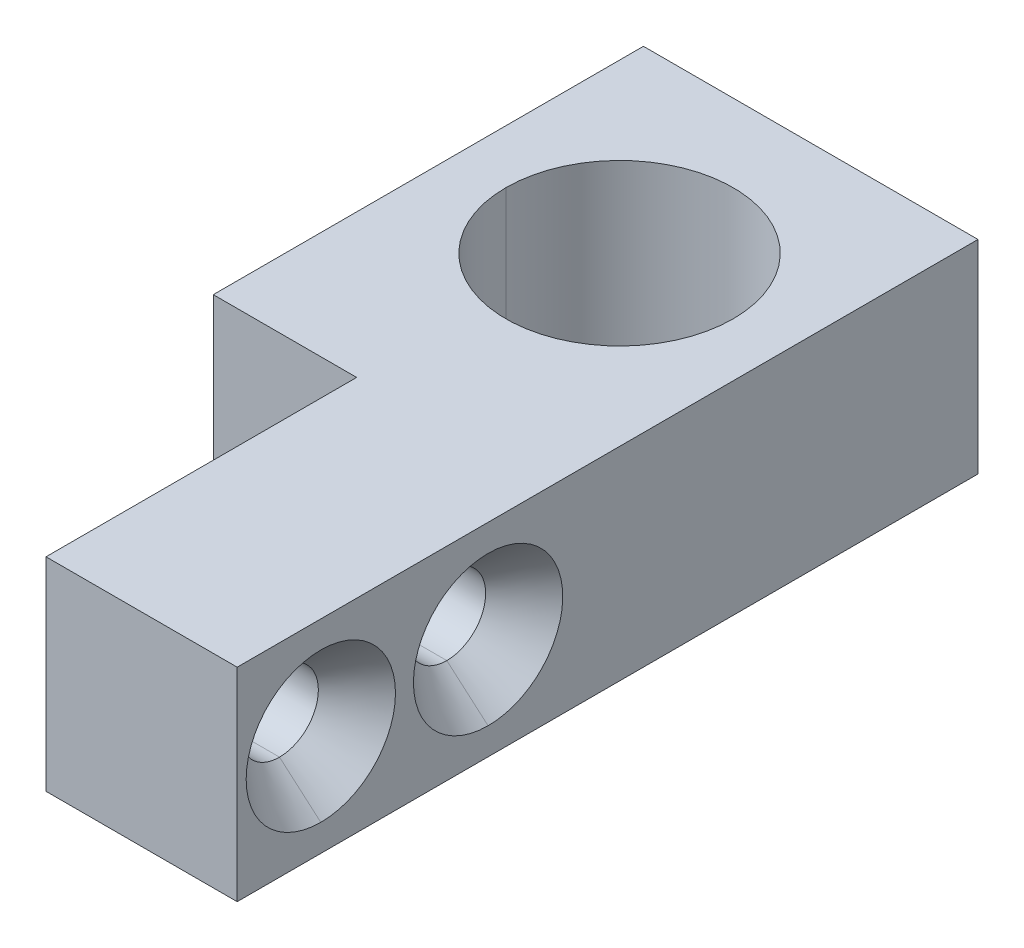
ISO-10303-21;
HEADER;
FILE_DESCRIPTION(('STEP AP214'),'2;1');
FILE_NAME('part.step','',(''),(''),'','','');
FILE_SCHEMA(('AUTOMOTIVE_DESIGN { 1 0 10303 214 1 1 1 1 }'));
ENDSEC;
DATA;
#1=APPLICATION_CONTEXT('core data for automotive mechanical design processes');
#2=APPLICATION_PROTOCOL_DEFINITION('international standard','automotive_design',2000,#1);
#3=PRODUCT_CONTEXT('',#1,'mechanical');
#4=PRODUCT('Part','Part','',(#3));
#5=PRODUCT_RELATED_PRODUCT_CATEGORY('part','',(#4));
#6=PRODUCT_DEFINITION_FORMATION('','',#4);
#7=PRODUCT_DEFINITION_CONTEXT('part definition',#1,'design');
#8=PRODUCT_DEFINITION('design','',#6,#7);
#9=PRODUCT_DEFINITION_SHAPE('','',#8);
#10=(LENGTH_UNIT() NAMED_UNIT(*) SI_UNIT(.MILLI.,.METRE.));
#11=(NAMED_UNIT(*) PLANE_ANGLE_UNIT() SI_UNIT($,.RADIAN.));
#12=(NAMED_UNIT(*) SI_UNIT($,.STERADIAN.) SOLID_ANGLE_UNIT());
#13=UNCERTAINTY_MEASURE_WITH_UNIT(LENGTH_MEASURE(1.E-05),#10,'distance_accuracy_value','');
#14=(GEOMETRIC_REPRESENTATION_CONTEXT(3) GLOBAL_UNCERTAINTY_ASSIGNED_CONTEXT((#13)) GLOBAL_UNIT_ASSIGNED_CONTEXT((#10,
#11,#12)) REPRESENTATION_CONTEXT('',''));
#15=CARTESIAN_POINT('',(0.,0.,0.));
#16=DIRECTION('',(0.,0.,1.));
#17=DIRECTION('',(1.,0.,0.));
#18=AXIS2_PLACEMENT_3D('',#15,#16,#17);
#19=CARTESIAN_POINT('',(16.2814000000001,0.,38.1));
#20=DIRECTION('',(-1.,0.,0.));
#21=DIRECTION('',(0.,0.,1.));
#22=AXIS2_PLACEMENT_3D('',#19,#20,#21);
#23=CYLINDRICAL_SURFACE('',#22,5.159375);
#24=CARTESIAN_POINT('',(-3.175,0.,38.1));
#25=DIRECTION('',(-1.,0.,0.));
#26=DIRECTION('',(0.,0.,1.));
#27=AXIS2_PLACEMENT_3D('',#24,#25,#26);
#28=CIRCLE('',#27,5.159375);
#29=CARTESIAN_POINT('',(-3.175,-5.159375,38.1));
#30=VERTEX_POINT('',#29);
#31=CARTESIAN_POINT('',(-3.175,5.159375,38.1));
#32=VERTEX_POINT('',#31);
#33=EDGE_CURVE('E228',#30,#32,#28,.T.);
#34=ORIENTED_EDGE('',*,*,#33,.T.);
#35=DIRECTION('',(-1.,0.,0.));
#36=VECTOR('',#35,1.);
#37=CARTESIAN_POINT('',(16.2814000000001,5.159375,38.1));
#38=LINE('',#37,#36);
#39=CARTESIAN_POINT('',(16.7388815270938,5.15937499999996,38.1));
#40=VERTEX_POINT('',#39);
#41=EDGE_CURVE('E175',#32,#40,#38,.F.);
#42=ORIENTED_EDGE('',*,*,#41,.T.);
#43=CARTESIAN_POINT('',(16.7388815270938,0.,38.1));
#44=DIRECTION('',(1.,0.,0.));
#45=DIRECTION('',(0.,1.,0.));
#46=AXIS2_PLACEMENT_3D('',#43,#44,#45);
#47=CIRCLE('',#46,5.15937499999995);
#48=CARTESIAN_POINT('',(16.7388815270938,-5.15937499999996,38.1));
#49=VERTEX_POINT('',#48);
#50=EDGE_CURVE('E147',#40,#49,#47,.T.);
#51=ORIENTED_EDGE('',*,*,#50,.T.);
#52=DIRECTION('',(-1.,0.,0.));
#53=VECTOR('',#52,1.);
#54=CARTESIAN_POINT('',(16.2814000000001,-5.159375,38.1));
#55=LINE('',#54,#53);
#56=EDGE_CURVE('E170',#49,#30,#55,.T.);
#57=ORIENTED_EDGE('',*,*,#56,.T.);
#58=EDGE_LOOP('',(#34,#42,#51,#57));
#59=FACE_BOUND('',#58,.T.);
#60=ADVANCED_FACE('F16',(#59),#23,.F.);
#61=CARTESIAN_POINT('',(16.2814000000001,0.,38.1));
#62=DIRECTION('',(-1.,0.,0.));
#63=DIRECTION('',(0.,0.,1.));
#64=AXIS2_PLACEMENT_3D('',#61,#62,#63);
#65=CYLINDRICAL_SURFACE('',#64,5.159375);
#66=CARTESIAN_POINT('',(16.7388815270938,0.,38.1));
#67=DIRECTION('',(1.,0.,0.));
#68=DIRECTION('',(0.,1.,0.));
#69=AXIS2_PLACEMENT_3D('',#66,#67,#68);
#70=CIRCLE('',#69,5.15937499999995);
#71=EDGE_CURVE('E141',#49,#40,#70,.T.);
#72=ORIENTED_EDGE('',*,*,#71,.T.);
#73=ORIENTED_EDGE('',*,*,#41,.F.);
#74=CARTESIAN_POINT('',(-3.175,0.,38.1));
#75=DIRECTION('',(-1.,0.,0.));
#76=DIRECTION('',(0.,0.,1.));
#77=AXIS2_PLACEMENT_3D('',#74,#75,#76);
#78=CIRCLE('',#77,5.159375);
#79=EDGE_CURVE('E225',#32,#30,#78,.T.);
#80=ORIENTED_EDGE('',*,*,#79,.T.);
#81=ORIENTED_EDGE('',*,*,#56,.F.);
#82=EDGE_LOOP('',(#72,#73,#80,#81));
#83=FACE_BOUND('',#82,.T.);
#84=ADVANCED_FACE('F310',(#83),#65,.F.);
#85=CARTESIAN_POINT('',(16.2814000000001,0.,15.875));
#86=DIRECTION('',(-1.,0.,0.));
#87=DIRECTION('',(0.,0.,1.));
#88=AXIS2_PLACEMENT_3D('',#85,#86,#87);
#89=CYLINDRICAL_SURFACE('',#88,5.159375);
#90=CARTESIAN_POINT('',(-3.175,0.,15.875));
#91=DIRECTION('',(-1.,0.,0.));
#92=DIRECTION('',(0.,0.,1.));
#93=AXIS2_PLACEMENT_3D('',#90,#91,#92);
#94=CIRCLE('',#93,5.159375);
#95=CARTESIAN_POINT('',(-3.175,-5.159375,15.875));
#96=VERTEX_POINT('',#95);
#97=CARTESIAN_POINT('',(-3.175,5.159375,15.875));
#98=VERTEX_POINT('',#97);
#99=EDGE_CURVE('E222',#96,#98,#94,.T.);
#100=ORIENTED_EDGE('',*,*,#99,.T.);
#101=DIRECTION('',(-1.,0.,0.));
#102=VECTOR('',#101,1.);
#103=CARTESIAN_POINT('',(16.2814000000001,5.159375,15.875));
#104=LINE('',#103,#102);
#105=CARTESIAN_POINT('',(16.7388815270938,5.15937499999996,15.875));
#106=VERTEX_POINT('',#105);
#107=EDGE_CURVE('E165',#98,#106,#104,.F.);
#108=ORIENTED_EDGE('',*,*,#107,.T.);
#109=CARTESIAN_POINT('',(16.7388815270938,0.,15.875));
#110=DIRECTION('',(1.,0.,0.));
#111=DIRECTION('',(0.,1.,0.));
#112=AXIS2_PLACEMENT_3D('',#109,#110,#111);
#113=CIRCLE('',#112,5.15937499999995);
#114=CARTESIAN_POINT('',(16.7388815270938,-5.15937499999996,15.875));
#115=VERTEX_POINT('',#114);
#116=EDGE_CURVE('E159',#106,#115,#113,.T.);
#117=ORIENTED_EDGE('',*,*,#116,.T.);
#118=DIRECTION('',(-1.,0.,0.));
#119=VECTOR('',#118,1.);
#120=CARTESIAN_POINT('',(16.2814000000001,-5.159375,15.875));
#121=LINE('',#120,#119);
#122=EDGE_CURVE('E162',#115,#96,#121,.T.);
#123=ORIENTED_EDGE('',*,*,#122,.T.);
#124=EDGE_LOOP('',(#100,#108,#117,#123));
#125=FACE_BOUND('',#124,.T.);
#126=ADVANCED_FACE('F307',(#125),#89,.F.);
#127=CARTESIAN_POINT('',(16.2814000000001,0.,15.875));
#128=DIRECTION('',(-1.,0.,0.));
#129=DIRECTION('',(0.,0.,1.));
#130=AXIS2_PLACEMENT_3D('',#127,#128,#129);
#131=CYLINDRICAL_SURFACE('',#130,5.159375);
#132=CARTESIAN_POINT('',(16.7388815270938,0.,15.875));
#133=DIRECTION('',(1.,0.,0.));
#134=DIRECTION('',(0.,1.,0.));
#135=AXIS2_PLACEMENT_3D('',#132,#133,#134);
#136=CIRCLE('',#135,5.15937499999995);
#137=EDGE_CURVE('E153',#115,#106,#136,.T.);
#138=ORIENTED_EDGE('',*,*,#137,.T.);
#139=ORIENTED_EDGE('',*,*,#107,.F.);
#140=CARTESIAN_POINT('',(-3.175,0.,15.875));
#141=DIRECTION('',(-1.,0.,0.));
#142=DIRECTION('',(0.,0.,1.));
#143=AXIS2_PLACEMENT_3D('',#140,#141,#142);
#144=CIRCLE('',#143,5.159375);
#145=EDGE_CURVE('E218',#98,#96,#144,.T.);
#146=ORIENTED_EDGE('',*,*,#145,.T.);
#147=ORIENTED_EDGE('',*,*,#122,.F.);
#148=EDGE_LOOP('',(#138,#139,#146,#147));
#149=FACE_BOUND('',#148,.T.);
#150=ADVANCED_FACE('F304',(#149),#131,.F.);
#151=CARTESIAN_POINT('',(9.525,13.49375,-20.6375));
#152=DIRECTION('',(0.,1.,0.));
#153=DIRECTION('',(0.,0.,1.));
#154=AXIS2_PLACEMENT_3D('',#151,#152,#153);
#155=PLANE('',#154);
#156=CARTESIAN_POINT('',(0.,13.49375,-23.8125));
#157=DIRECTION('',(0.,-1.,0.));
#158=DIRECTION('',(0.,0.,-1.));
#159=AXIS2_PLACEMENT_3D('',#156,#157,#158);
#160=CIRCLE('',#159,15.1003);
#161=CARTESIAN_POINT('',(15.1003,13.49375,-23.8125));
#162=VERTEX_POINT('',#161);
#163=CARTESIAN_POINT('',(-15.1003,13.49375,-23.8125000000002));
#164=VERTEX_POINT('',#163);
#165=EDGE_CURVE('E19',#162,#164,#160,.T.);
#166=ORIENTED_EDGE('',*,*,#165,.T.);
#167=CARTESIAN_POINT('',(0.,13.49375,-23.8125));
#168=DIRECTION('',(0.,-1.,0.));
#169=DIRECTION('',(0.,0.,-1.));
#170=AXIS2_PLACEMENT_3D('',#167,#168,#169);
#171=CIRCLE('',#170,15.1003);
#172=EDGE_CURVE('E124',#164,#162,#171,.T.);
#173=ORIENTED_EDGE('',*,*,#172,.T.);
#174=EDGE_LOOP('',(#166,#173));
#175=FACE_BOUND('',#174,.T.);
#176=DIRECTION('',(1.,0.,0.));
#177=VECTOR('',#176,1.);
#178=CARTESIAN_POINT('',(9.525,13.49375,-49.2125));
#179=LINE('',#178,#177);
#180=CARTESIAN_POINT('',(22.225,13.49375,-49.2125));
#181=VERTEX_POINT('',#180);
#182=CARTESIAN_POINT('',(-22.225,13.49375,-49.2125));
#183=VERTEX_POINT('',#182);
#184=EDGE_CURVE('E245',#181,#183,#179,.F.);
#185=ORIENTED_EDGE('',*,*,#184,.T.);
#186=DIRECTION('',(0.,0.,-1.));
#187=VECTOR('',#186,1.);
#188=CARTESIAN_POINT('',(-22.225,13.49375,-20.6375));
#189=LINE('',#188,#187);
#190=CARTESIAN_POINT('',(-22.225,13.49375,7.9375));
#191=VERTEX_POINT('',#190);
#192=EDGE_CURVE('E237',#183,#191,#189,.F.);
#193=ORIENTED_EDGE('',*,*,#192,.T.);
#194=DIRECTION('',(-1.,0.,0.));
#195=VECTOR('',#194,1.);
#196=CARTESIAN_POINT('',(9.525,13.49375,7.9375));
#197=LINE('',#196,#195);
#198=CARTESIAN_POINT('',(-3.175,13.49375,7.9375));
#199=VERTEX_POINT('',#198);
#200=EDGE_CURVE('E230',#191,#199,#197,.F.);
#201=ORIENTED_EDGE('',*,*,#200,.T.);
#202=DIRECTION('',(0.,0.,-1.));
#203=VECTOR('',#202,1.);
#204=CARTESIAN_POINT('',(-3.175,13.49375,17.4625));
#205=LINE('',#204,#203);
#206=CARTESIAN_POINT('',(-3.175,13.49375,49.2125));
#207=VERTEX_POINT('',#206);
#208=EDGE_CURVE('E337',#199,#207,#205,.F.);
#209=ORIENTED_EDGE('',*,*,#208,.T.);
#210=DIRECTION('',(-1.,0.,0.));
#211=VECTOR('',#210,1.);
#212=CARTESIAN_POINT('',(17.4625,13.49375,49.2125));
#213=LINE('',#212,#211);
#214=CARTESIAN_POINT('',(22.225,13.49375,49.2125));
#215=VERTEX_POINT('',#214);
#216=EDGE_CURVE('E329',#207,#215,#213,.F.);
#217=ORIENTED_EDGE('',*,*,#216,.T.);
#218=DIRECTION('',(0.,0.,1.));
#219=VECTOR('',#218,1.);
#220=CARTESIAN_POINT('',(22.225,13.49375,-20.6375));
#221=LINE('',#220,#219);
#222=EDGE_CURVE('E325',#215,#181,#221,.F.);
#223=ORIENTED_EDGE('',*,*,#222,.T.);
#224=EDGE_LOOP('',(#185,#193,#201,#209,#217,#223));
#225=FACE_BOUND('',#224,.T.);
#226=ADVANCED_FACE('F122',(#175,#225),#155,.T.);
#227=CARTESIAN_POINT('',(22.225,0.,15.875));
#228=DIRECTION('',(1.,0.,0.));
#229=DIRECTION('',(0.,0.,-1.));
#230=AXIS2_PLACEMENT_3D('',#227,#228,#229);
#231=CONICAL_SURFACE('',#230,9.91869999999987,0.714578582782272);
#232=CARTESIAN_POINT('',(22.225,0.,15.875));
#233=DIRECTION('',(1.,0.,0.));
#234=DIRECTION('',(0.,0.,-1.));
#235=AXIS2_PLACEMENT_3D('',#232,#233,#234);
#236=CIRCLE('',#235,9.91869999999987);
#237=CARTESIAN_POINT('',(22.225,9.91869999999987,15.875));
#238=VERTEX_POINT('',#237);
#239=CARTESIAN_POINT('',(22.225,-9.91869999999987,15.875));
#240=VERTEX_POINT('',#239);
#241=EDGE_CURVE('E214',#238,#240,#236,.T.);
#242=ORIENTED_EDGE('',*,*,#241,.T.);
#243=DIRECTION('',(-0.755369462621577,0.655299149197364,0.));
#244=VECTOR('',#243,1.);
#245=CARTESIAN_POINT('',(19.2532000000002,-7.34060000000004,15.875));
#246=LINE('',#245,#244);
#247=EDGE_CURVE('E156',#240,#115,#246,.T.);
#248=ORIENTED_EDGE('',*,*,#247,.T.);
#249=ORIENTED_EDGE('',*,*,#116,.F.);
#250=DIRECTION('',(-0.755369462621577,-0.655299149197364,0.));
#251=VECTOR('',#250,1.);
#252=CARTESIAN_POINT('',(19.2532000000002,7.34060000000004,15.875));
#253=LINE('',#252,#251);
#254=EDGE_CURVE('E150',#106,#238,#253,.F.);
#255=ORIENTED_EDGE('',*,*,#254,.T.);
#256=EDGE_LOOP('',(#242,#248,#249,#255));
#257=FACE_BOUND('',#256,.T.);
#258=ADVANCED_FACE('F297',(#257),#231,.F.);
#259=CARTESIAN_POINT('',(22.225,0.,15.875));
#260=DIRECTION('',(1.,0.,0.));
#261=DIRECTION('',(0.,0.,-1.));
#262=AXIS2_PLACEMENT_3D('',#259,#260,#261);
#263=CONICAL_SURFACE('',#262,9.91869999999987,0.714578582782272);
#264=ORIENTED_EDGE('',*,*,#137,.F.);
#265=ORIENTED_EDGE('',*,*,#247,.F.);
#266=CARTESIAN_POINT('',(22.225,0.,15.875));
#267=DIRECTION('',(1.,0.,0.));
#268=DIRECTION('',(0.,0.,-1.));
#269=AXIS2_PLACEMENT_3D('',#266,#267,#268);
#270=CIRCLE('',#269,9.91869999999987);
#271=CARTESIAN_POINT('',(22.225,-5.94783182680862,7.9375));
#272=VERTEX_POINT('',#271);
#273=EDGE_CURVE('E211',#240,#272,#270,.T.);
#274=ORIENTED_EDGE('',*,*,#273,.T.);
#275=CARTESIAN_POINT('',(22.225,0.,15.875));
#276=DIRECTION('',(1.,0.,0.));
#277=DIRECTION('',(0.,0.,-1.));
#278=AXIS2_PLACEMENT_3D('',#275,#276,#277);
#279=CIRCLE('',#278,9.91869999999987);
#280=EDGE_CURVE('E208',#272,#238,#279,.T.);
#281=ORIENTED_EDGE('',*,*,#280,.T.);
#282=ORIENTED_EDGE('',*,*,#254,.F.);
#283=EDGE_LOOP('',(#264,#265,#274,#281,#282));
#284=FACE_BOUND('',#283,.T.);
#285=ADVANCED_FACE('F293',(#284),#263,.F.);
#286=CARTESIAN_POINT('',(22.225,0.,38.1));
#287=DIRECTION('',(1.,0.,0.));
#288=DIRECTION('',(0.,0.,-1.));
#289=AXIS2_PLACEMENT_3D('',#286,#287,#288);
#290=CONICAL_SURFACE('',#289,9.91869999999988,0.714578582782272);
#291=CARTESIAN_POINT('',(22.225,0.,38.1));
#292=DIRECTION('',(1.,0.,0.));
#293=DIRECTION('',(0.,0.,-1.));
#294=AXIS2_PLACEMENT_3D('',#291,#292,#293);
#295=CIRCLE('',#294,9.91869999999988);
#296=CARTESIAN_POINT('',(22.225,9.91869999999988,38.1));
#297=VERTEX_POINT('',#296);
#298=CARTESIAN_POINT('',(22.225,-9.91869999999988,38.1));
#299=VERTEX_POINT('',#298);
#300=EDGE_CURVE('E205',#297,#299,#295,.T.);
#301=ORIENTED_EDGE('',*,*,#300,.T.);
#302=DIRECTION('',(-0.755369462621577,0.655299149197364,0.));
#303=VECTOR('',#302,1.);
#304=CARTESIAN_POINT('',(19.2532000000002,-7.34060000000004,38.1));
#305=LINE('',#304,#303);
#306=EDGE_CURVE('E144',#299,#49,#305,.T.);
#307=ORIENTED_EDGE('',*,*,#306,.T.);
#308=ORIENTED_EDGE('',*,*,#50,.F.);
#309=DIRECTION('',(-0.755369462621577,-0.655299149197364,0.));
#310=VECTOR('',#309,1.);
#311=CARTESIAN_POINT('',(19.2532000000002,7.34060000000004,38.1));
#312=LINE('',#311,#310);
#313=EDGE_CURVE('E126',#40,#297,#312,.F.);
#314=ORIENTED_EDGE('',*,*,#313,.T.);
#315=EDGE_LOOP('',(#301,#307,#308,#314));
#316=FACE_BOUND('',#315,.T.);
#317=ADVANCED_FACE('F289',(#316),#290,.F.);
#318=CARTESIAN_POINT('',(22.225,0.,38.1));
#319=DIRECTION('',(1.,0.,0.));
#320=DIRECTION('',(0.,0.,-1.));
#321=AXIS2_PLACEMENT_3D('',#318,#319,#320);
#322=CONICAL_SURFACE('',#321,9.91869999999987,0.714578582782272);
#323=ORIENTED_EDGE('',*,*,#71,.F.);
#324=ORIENTED_EDGE('',*,*,#306,.F.);
#325=CARTESIAN_POINT('',(22.225,0.,38.1));
#326=DIRECTION('',(1.,0.,0.));
#327=DIRECTION('',(0.,0.,-1.));
#328=AXIS2_PLACEMENT_3D('',#325,#326,#327);
#329=CIRCLE('',#328,9.91869999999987);
#330=EDGE_CURVE('E202',#299,#297,#329,.T.);
#331=ORIENTED_EDGE('',*,*,#330,.T.);
#332=ORIENTED_EDGE('',*,*,#313,.F.);
#333=EDGE_LOOP('',(#323,#324,#331,#332));
#334=FACE_BOUND('',#333,.T.);
#335=ADVANCED_FACE('F286',(#334),#322,.F.);
#336=CARTESIAN_POINT('',(0.,0.79375,-23.8125));
#337=DIRECTION('',(0.,-1.,0.));
#338=DIRECTION('',(0.,0.,-1.));
#339=AXIS2_PLACEMENT_3D('',#336,#337,#338);
#340=CYLINDRICAL_SURFACE('',#339,15.1003);
#341=CARTESIAN_POINT('',(0.,-13.49375,-23.8125));
#342=DIRECTION('',(0.,-1.,0.));
#343=DIRECTION('',(0.,0.,-1.));
#344=AXIS2_PLACEMENT_3D('',#341,#342,#343);
#345=CIRCLE('',#344,15.1003);
#346=CARTESIAN_POINT('',(15.1003,-13.49375,-23.8125));
#347=VERTEX_POINT('',#346);
#348=CARTESIAN_POINT('',(-15.1003,-13.49375,-23.8125));
#349=VERTEX_POINT('',#348);
#350=EDGE_CURVE('E134',#347,#349,#345,.T.);
#351=ORIENTED_EDGE('',*,*,#350,.T.);
#352=DIRECTION('',(0.,-1.,0.));
#353=VECTOR('',#352,1.);
#354=CARTESIAN_POINT('',(-15.1003,0.79375,-23.8125));
#355=LINE('',#354,#353);
#356=EDGE_CURVE('E125',#349,#164,#355,.F.);
#357=ORIENTED_EDGE('',*,*,#356,.T.);
#358=ORIENTED_EDGE('',*,*,#165,.F.);
#359=DIRECTION('',(0.,-1.,0.));
#360=VECTOR('',#359,1.);
#361=CARTESIAN_POINT('',(15.1003,0.79375,-23.8125));
#362=LINE('',#361,#360);
#363=EDGE_CURVE('E131',#162,#347,#362,.T.);
#364=ORIENTED_EDGE('',*,*,#363,.T.);
#365=EDGE_LOOP('',(#351,#357,#358,#364));
#366=FACE_BOUND('',#365,.T.);
#367=ADVANCED_FACE('F133',(#366),#340,.F.);
#368=CARTESIAN_POINT('',(0.,0.79375,-23.8125));
#369=DIRECTION('',(0.,-1.,0.));
#370=DIRECTION('',(0.,0.,-1.));
#371=AXIS2_PLACEMENT_3D('',#368,#369,#370);
#372=CYLINDRICAL_SURFACE('',#371,15.1003);
#373=ORIENTED_EDGE('',*,*,#172,.F.);
#374=ORIENTED_EDGE('',*,*,#356,.F.);
#375=CARTESIAN_POINT('',(0.,-13.49375,-23.8125));
#376=DIRECTION('',(0.,-1.,0.));
#377=DIRECTION('',(0.,0.,-1.));
#378=AXIS2_PLACEMENT_3D('',#375,#376,#377);
#379=CIRCLE('',#378,15.1003);
#380=EDGE_CURVE('E198',#349,#347,#379,.T.);
#381=ORIENTED_EDGE('',*,*,#380,.T.);
#382=ORIENTED_EDGE('',*,*,#363,.F.);
#383=EDGE_LOOP('',(#373,#374,#381,#382));
#384=FACE_BOUND('',#383,.T.);
#385=ADVANCED_FACE('F128',(#384),#372,.F.);
#386=CARTESIAN_POINT('',(9.525,0.,-49.2125));
#387=DIRECTION('',(0.,0.,1.));
#388=DIRECTION('',(1.,0.,0.));
#389=AXIS2_PLACEMENT_3D('',#386,#387,#388);
#390=PLANE('',#389);
#391=DIRECTION('',(0.,1.,0.));
#392=VECTOR('',#391,1.);
#393=CARTESIAN_POINT('',(-22.225,0.,-49.2125));
#394=LINE('',#393,#392);
#395=CARTESIAN_POINT('',(-22.225,-13.49375,-49.2125));
#396=VERTEX_POINT('',#395);
#397=EDGE_CURVE('E243',#396,#183,#394,.T.);
#398=ORIENTED_EDGE('',*,*,#397,.T.);
#399=ORIENTED_EDGE('',*,*,#184,.F.);
#400=DIRECTION('',(0.,1.,0.));
#401=VECTOR('',#400,1.);
#402=CARTESIAN_POINT('',(22.225,0.,-49.2125));
#403=LINE('',#402,#401);
#404=CARTESIAN_POINT('',(22.225,-13.49375,-49.2125));
#405=VERTEX_POINT('',#404);
#406=EDGE_CURVE('E217',#181,#405,#403,.F.);
#407=ORIENTED_EDGE('',*,*,#406,.T.);
#408=DIRECTION('',(1.,0.,0.));
#409=VECTOR('',#408,1.);
#410=CARTESIAN_POINT('',(9.525,-13.49375,-49.2125));
#411=LINE('',#410,#409);
#412=EDGE_CURVE('E200',#405,#396,#411,.F.);
#413=ORIENTED_EDGE('',*,*,#412,.T.);
#414=EDGE_LOOP('',(#398,#399,#407,#413));
#415=FACE_BOUND('',#414,.T.);
#416=ADVANCED_FACE('F277',(#415),#390,.F.);
#417=CARTESIAN_POINT('',(-22.225,0.,-20.6375));
#418=DIRECTION('',(1.,0.,0.));
#419=DIRECTION('',(0.,0.,-1.));
#420=AXIS2_PLACEMENT_3D('',#417,#418,#419);
#421=PLANE('',#420);
#422=ORIENTED_EDGE('',*,*,#192,.F.);
#423=ORIENTED_EDGE('',*,*,#397,.F.);
#424=DIRECTION('',(0.,0.,1.));
#425=VECTOR('',#424,1.);
#426=CARTESIAN_POINT('',(-22.225,-13.49375,-20.6375));
#427=LINE('',#426,#425);
#428=CARTESIAN_POINT('',(-22.225,-13.49375,7.9375));
#429=VERTEX_POINT('',#428);
#430=EDGE_CURVE('E351',#396,#429,#427,.T.);
#431=ORIENTED_EDGE('',*,*,#430,.T.);
#432=DIRECTION('',(0.,1.,0.));
#433=VECTOR('',#432,1.);
#434=CARTESIAN_POINT('',(-22.225,0.,7.9375));
#435=LINE('',#434,#433);
#436=EDGE_CURVE('E232',#429,#191,#435,.T.);
#437=ORIENTED_EDGE('',*,*,#436,.T.);
#438=EDGE_LOOP('',(#422,#423,#431,#437));
#439=FACE_BOUND('',#438,.T.);
#440=ADVANCED_FACE('F273',(#439),#421,.F.);
#441=CARTESIAN_POINT('',(9.525,0.,7.9375));
#442=DIRECTION('',(0.,0.,-1.));
#443=DIRECTION('',(-1.,0.,0.));
#444=AXIS2_PLACEMENT_3D('',#441,#442,#443);
#445=PLANE('',#444);
#446=ORIENTED_EDGE('',*,*,#200,.F.);
#447=ORIENTED_EDGE('',*,*,#436,.F.);
#448=DIRECTION('',(1.,0.,0.));
#449=VECTOR('',#448,1.);
#450=CARTESIAN_POINT('',(9.525,-13.49375,7.9375));
#451=LINE('',#450,#449);
#452=CARTESIAN_POINT('',(-3.175,-13.49375,7.9375));
#453=VERTEX_POINT('',#452);
#454=EDGE_CURVE('E341',#429,#453,#451,.T.);
#455=ORIENTED_EDGE('',*,*,#454,.T.);
#456=DIRECTION('',(0.,1.,0.));
#457=VECTOR('',#456,1.);
#458=CARTESIAN_POINT('',(-3.175,0.,7.9375));
#459=LINE('',#458,#457);
#460=EDGE_CURVE('E221',#453,#199,#459,.T.);
#461=ORIENTED_EDGE('',*,*,#460,.T.);
#462=EDGE_LOOP('',(#446,#447,#455,#461));
#463=FACE_BOUND('',#462,.T.);
#464=ADVANCED_FACE('F269',(#463),#445,.F.);
#465=CARTESIAN_POINT('',(-3.175,0.,17.4625));
#466=DIRECTION('',(1.,0.,0.));
#467=DIRECTION('',(0.,0.,-1.));
#468=AXIS2_PLACEMENT_3D('',#465,#466,#467);
#469=PLANE('',#468);
#470=DIRECTION('',(0.,1.,0.));
#471=VECTOR('',#470,1.);
#472=CARTESIAN_POINT('',(-3.175,0.,49.2125));
#473=LINE('',#472,#471);
#474=CARTESIAN_POINT('',(-3.175,-13.49375,49.2125));
#475=VERTEX_POINT('',#474);
#476=EDGE_CURVE('E335',#475,#207,#473,.T.);
#477=ORIENTED_EDGE('',*,*,#476,.T.);
#478=ORIENTED_EDGE('',*,*,#208,.F.);
#479=ORIENTED_EDGE('',*,*,#460,.F.);
#480=DIRECTION('',(0.,0.,1.));
#481=VECTOR('',#480,1.);
#482=CARTESIAN_POINT('',(-3.175,-13.49375,-20.6375));
#483=LINE('',#482,#481);
#484=EDGE_CURVE('E345',#453,#475,#483,.T.);
#485=ORIENTED_EDGE('',*,*,#484,.T.);
#486=EDGE_LOOP('',(#477,#478,#479,#485));
#487=FACE_BOUND('',#486,.T.);
#488=ORIENTED_EDGE('',*,*,#99,.F.);
#489=ORIENTED_EDGE('',*,*,#145,.F.);
#490=EDGE_LOOP('',(#488,#489));
#491=FACE_BOUND('',#490,.T.);
#492=ORIENTED_EDGE('',*,*,#33,.F.);
#493=ORIENTED_EDGE('',*,*,#79,.F.);
#494=EDGE_LOOP('',(#492,#493));
#495=FACE_BOUND('',#494,.T.);
#496=ADVANCED_FACE('F265',(#487,#491,#495),#469,.F.);
#497=CARTESIAN_POINT('',(17.4625,0.,49.2125));
#498=DIRECTION('',(0.,0.,-1.));
#499=DIRECTION('',(-1.,0.,0.));
#500=AXIS2_PLACEMENT_3D('',#497,#498,#499);
#501=PLANE('',#500);
#502=ORIENTED_EDGE('',*,*,#216,.F.);
#503=ORIENTED_EDGE('',*,*,#476,.F.);
#504=DIRECTION('',(1.,0.,0.));
#505=VECTOR('',#504,1.);
#506=CARTESIAN_POINT('',(9.525,-13.49375,49.2125));
#507=LINE('',#506,#505);
#508=CARTESIAN_POINT('',(22.225,-13.49375,49.2125));
#509=VERTEX_POINT('',#508);
#510=EDGE_CURVE('E25',#475,#509,#507,.T.);
#511=ORIENTED_EDGE('',*,*,#510,.T.);
#512=DIRECTION('',(0.,1.,0.));
#513=VECTOR('',#512,1.);
#514=CARTESIAN_POINT('',(22.225,0.,49.2125));
#515=LINE('',#514,#513);
#516=EDGE_CURVE('E33',#509,#215,#515,.T.);
#517=ORIENTED_EDGE('',*,*,#516,.T.);
#518=EDGE_LOOP('',(#502,#503,#511,#517));
#519=FACE_BOUND('',#518,.T.);
#520=ADVANCED_FACE('F258',(#519),#501,.F.);
#521=CARTESIAN_POINT('',(22.225,0.,-20.6375));
#522=DIRECTION('',(-1.,0.,0.));
#523=DIRECTION('',(0.,0.,1.));
#524=AXIS2_PLACEMENT_3D('',#521,#522,#523);
#525=PLANE('',#524);
#526=ORIENTED_EDGE('',*,*,#300,.F.);
#527=ORIENTED_EDGE('',*,*,#330,.F.);
#528=EDGE_LOOP('',(#526,#527));
#529=FACE_BOUND('',#528,.T.);
#530=ORIENTED_EDGE('',*,*,#273,.F.);
#531=ORIENTED_EDGE('',*,*,#241,.F.);
#532=ORIENTED_EDGE('',*,*,#280,.F.);
#533=EDGE_LOOP('',(#530,#531,#532));
#534=FACE_BOUND('',#533,.T.);
#535=ORIENTED_EDGE('',*,*,#406,.F.);
#536=ORIENTED_EDGE('',*,*,#222,.F.);
#537=ORIENTED_EDGE('',*,*,#516,.F.);
#538=DIRECTION('',(0.,0.,1.));
#539=VECTOR('',#538,1.);
#540=CARTESIAN_POINT('',(22.225,-13.49375,-20.6375));
#541=LINE('',#540,#539);
#542=EDGE_CURVE('E11',#509,#405,#541,.F.);
#543=ORIENTED_EDGE('',*,*,#542,.T.);
#544=EDGE_LOOP('',(#535,#536,#537,#543));
#545=FACE_BOUND('',#544,.T.);
#546=ADVANCED_FACE('F251',(#529,#534,#545),#525,.F.);
#547=CARTESIAN_POINT('',(9.525,-13.49375,-20.6375));
#548=DIRECTION('',(0.,1.,0.));
#549=DIRECTION('',(0.,0.,1.));
#550=AXIS2_PLACEMENT_3D('',#547,#548,#549);
#551=PLANE('',#550);
#552=ORIENTED_EDGE('',*,*,#510,.F.);
#553=ORIENTED_EDGE('',*,*,#484,.F.);
#554=ORIENTED_EDGE('',*,*,#454,.F.);
#555=ORIENTED_EDGE('',*,*,#430,.F.);
#556=ORIENTED_EDGE('',*,*,#412,.F.);
#557=ORIENTED_EDGE('',*,*,#542,.F.);
#558=EDGE_LOOP('',(#552,#553,#554,#555,#556,#557));
#559=FACE_BOUND('',#558,.T.);
#560=ORIENTED_EDGE('',*,*,#350,.F.);
#561=ORIENTED_EDGE('',*,*,#380,.F.);
#562=EDGE_LOOP('',(#560,#561));
#563=FACE_BOUND('',#562,.T.);
#564=ADVANCED_FACE('F249',(#559,#563),#551,.F.);
#565=CLOSED_SHELL('',(#60,#84,#126,#150,#226,#258,#285,#317,#335,#367,#385,#416,#440,#464,#496,
#520,#546,#564));
#566=MANIFOLD_SOLID_BREP('B1',#565);
#567=ADVANCED_BREP_SHAPE_REPRESENTATION('',(#18,#566),#14);
#568=SHAPE_DEFINITION_REPRESENTATION(#9,#567);
ENDSEC;
END-ISO-10303-21;
